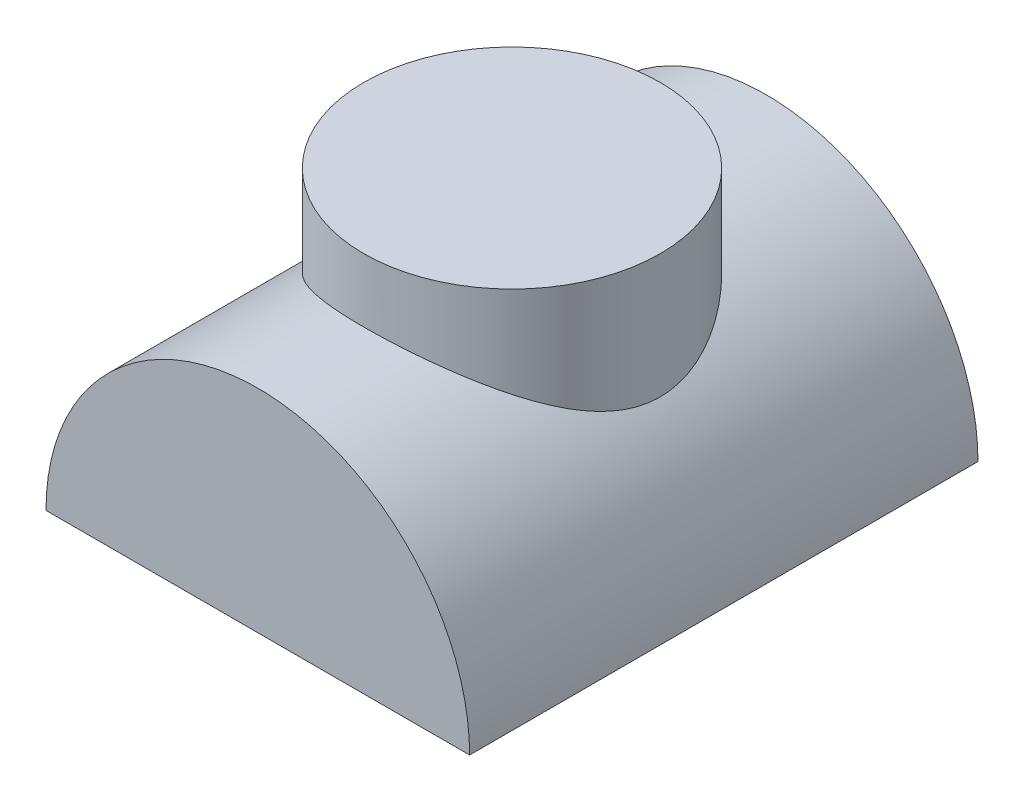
from build123d import *

# Parameters (mm, degrees)
EXTRUDE_1_DEPTH = 60


with BuildPart() as part:
    # Sketch 1 → Extrude 1 (new, symmetric)
    with BuildSketch(Plane.XY):
        with BuildLine():
            Line((50, 0), (-50, 0))
            ThreePointArc((-50, 0), (0, 50), (50, 0))
        make_face()
    extrude(amount=EXTRUDE_1_DEPTH, both=True)

    # Sketch 2 → Revolve 1 (revolve)
    with BuildSketch(Plane.XY, mode=Mode.PRIVATE) as revolve_1_sk:
        with BuildLine():
            Line((0, 65), (-35, 65))
            Line((-35, 65), (-35, 35.707142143))
            ThreePointArc((-35, 35.707142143), (-18.902948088, 46.289075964), (0, 50))
            Line((0, 50), (0, 65))
        make_face()
    revolve(revolve_1_sk.sketch.rotate(Axis((0, 0, 0), (0, 1, 0)), 270), axis=Axis((0, 0, 0), (0, 1, 0)))


solid = part.part
